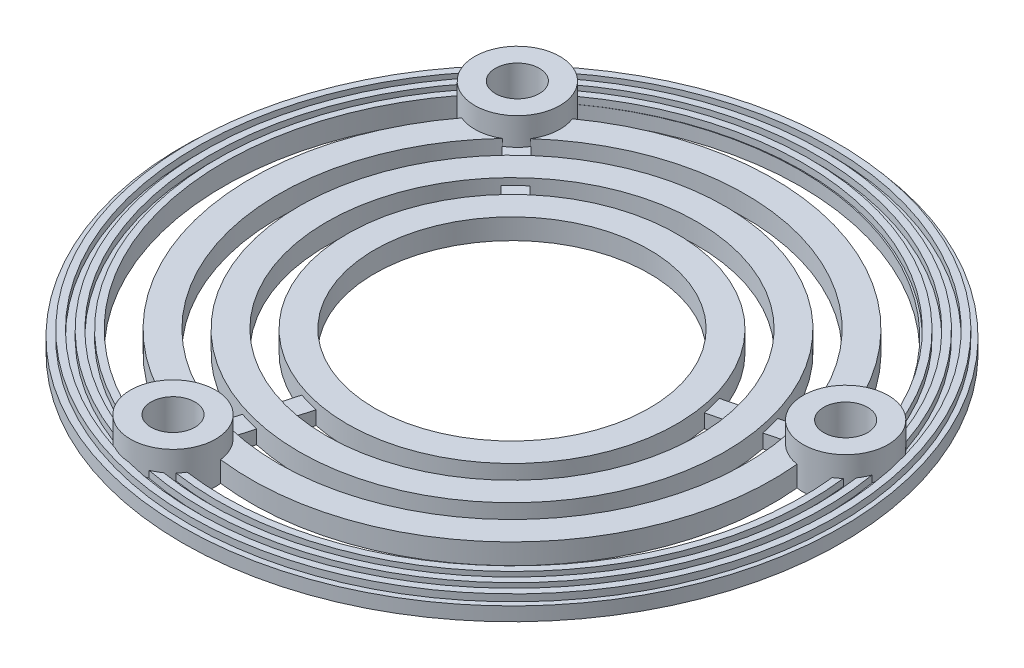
from build123d import *

# Parameters (mm, degrees)
SKETCH1_R             = 24
SKETCH1_R_2           = 21
BOSS_EXTRUDE1_DEPTH   = 1
SKETCH1_R_3           = 12
SKETCH1_R_4           = 10
BOSS_EXTRUDE1_2_DEPTH = 1
SKETCH1_R_5           = 15.5
SKETCH1_R_6           = 13.5
BOSS_EXTRUDE1_3_DEPTH = 1
SKETCH1_R_7           = 19
SKETCH1_R_8           = 17
BOSS_EXTRUDE1_4_DEPTH = 1
BOSS_EXTRUDE2_DEPTH   = 1
CIRPATTERN1_COUNT     = 3
SKETCH5_R             = 23.563954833
SKETCH5_R_2           = 23.063954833
SKETCH5_R_3           = 22.563954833
SKETCH5_R_4           = 22.063954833
SKETCH5_R_5           = 21.563954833
BOSS_EXTRUDE4_DEPTH   = 0.5
SKETCH6_R             = 10
BOSS_EXTRUDE5_DEPTH   = 0.5
BOSS_EXTRUDE3_START   = -1
SKETCH3_R             = 3.1
SKETCH3_R_2           = 1.6
BOSS_EXTRUDE3_DEPTH   = 3
CUT_EXTRUDE1_START    = -5
SKETCH4_R             = 1.6
CUT_EXTRUDE1_DEPTH    = 5
CIRPATTERN2_COUNT     = 3


with BuildPart() as part:
    # Sketch1 → Boss-Extrude1 (new body)
    with BuildSketch(Plane(origin=(0, 0, 0), x_dir=(1, 0, 0), z_dir=(0, 1, 0))):
        with Locations(Location((-0.095100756, -6.830064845, 0), (0, 0, 270))):
            Circle(SKETCH1_R)
        with Locations(Location((-0.095100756, -6.830064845, 0), (0, 0, 270))):
            Circle(SKETCH1_R_2, mode=Mode.SUBTRACT)
    extrude(amount=BOSS_EXTRUDE1_DEPTH)



with BuildPart() as body_2:
    # Sketch1 → Boss-Extrude1 2 (new body)
    with BuildSketch(Plane(origin=(0, 0, 0), x_dir=(1, 0, 0), z_dir=(0, 1, 0))):
        with Locations(Location((-0.095100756, -6.830064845, 0), (0, 0, 270))):
            Circle(SKETCH1_R_3)
        with Locations(Location((-0.095100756, -6.830064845, 0), (0, 0, 270))):
            Circle(SKETCH1_R_4, mode=Mode.SUBTRACT)
    extrude(amount=BOSS_EXTRUDE1_2_DEPTH)


with BuildPart() as body_3:
    # Sketch1 → Boss-Extrude1 3 (new body)
    with BuildSketch(Plane(origin=(0, 0, 0), x_dir=(1, 0, 0), z_dir=(0, 1, 0))):
        with Locations(Location((-0.095100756, -6.830064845, 0), (0, 0, 270))):
            Circle(SKETCH1_R_5)
        with Locations(Location((-0.095100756, -6.830064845, 0), (0, 0, 270))):
            Circle(SKETCH1_R_6, mode=Mode.SUBTRACT)
    extrude(amount=BOSS_EXTRUDE1_3_DEPTH)


with BuildPart() as body_4:
    # Sketch1 → Boss-Extrude1 4 (new body)
    with BuildSketch(Plane(origin=(0, 0, 0), x_dir=(1, 0, 0), z_dir=(0, 1, 0))):
        with Locations(Location((-0.095100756, -6.830064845, 0), (0, 0, 270))):
            Circle(SKETCH1_R_7)
        with Locations(Location((-0.095100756, -6.830064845, 0), (0, 0, 270))):
            Circle(SKETCH1_R_8, mode=Mode.SUBTRACT)
    extrude(amount=BOSS_EXTRUDE1_4_DEPTH)


with BuildPart() as part_1:
    add(part.part)

    add(body_2.part)  # Boss-Extrude2 merges body 2

    add(body_3.part)  # Boss-Extrude2 merges body 3

    add(body_4.part)  # Boss-Extrude2 merges body 4
    # Sketch2 → Boss-Extrude2 (add)
    with BuildSketch(Plane(origin=(0, 1, 0), x_dir=(1, 0, 0), z_dir=(0, 1, 0))):
        Polygon((-7.908749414, 2.277453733), (-16.284527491, 10.887227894), (-17.359697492, 9.841278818), (-8.983919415, 1.231504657), align=None)
    boss_extrude2 = extrude(amount=-BOSS_EXTRUDE2_DEPTH)

    # CirPattern1: Boss-Extrude2 ×3 about axis
    cirpattern1_axis = Axis((-0.095100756, 0, 6.830064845), (0, 1, 0))
    for i in range(1, CIRPATTERN1_COUNT):
        add(boss_extrude2.rotate(cirpattern1_axis, i * 360 / CIRPATTERN1_COUNT))

    # Sketch5 → Boss-Extrude4 (add)
    # profile 1 of 3: a face of its own
    with BuildSketch(Plane(origin=(0, 1, 0), x_dir=(1, 0, 0), z_dir=(0, 1, 0))):
        with Locations(Location((0, -6.830064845, 0), (0, 0, 270))):
            Circle(SKETCH5_R)
        with Locations(Location((0, -6.830064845, 0), (0, 0, 270))):
            Circle(SKETCH5_R_2, mode=Mode.SUBTRACT)
    # profile 2 of 3: a face of its own
    with BuildSketch(Plane(origin=(0, 1, 0), x_dir=(1, 0, 0), z_dir=(0, 1, 0))):
        with Locations(Location((0, -6.830064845, 0), (0, 0, 270))):
            Circle(SKETCH5_R_3)
        with Locations(Location((0, -6.830064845, 0), (0, 0, 270))):
            Circle(SKETCH5_R_4, mode=Mode.SUBTRACT)
    # profile 3 of 3: a face of its own
    with BuildSketch(Plane(origin=(0, 1, 0), x_dir=(1, 0, 0), z_dir=(0, 1, 0))):
        with Locations(Location((0, -6.830064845, 0), (0, 0, 270))):
            Circle(SKETCH5_R_5)
        with BuildLine():
            ThreePointArc((-15.26324398, 7.68625619), (7.816198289, 12.730028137), (21.063954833, -6.830064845))
            ThreePointArc((21.063954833, -6.830064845), (8.507699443, -26.099451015), (-14.191461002, -22.395816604))
            ThreePointArc((-14.191461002, -22.395816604), (-21.081703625, -7.580064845), (-15.266631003, 7.689737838))
            Line((-15.266631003, 7.689737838), (-15.26324398, 7.68625619))
        make_face(mode=Mode.SUBTRACT)
    extrude(amount=BOSS_EXTRUDE4_DEPTH)

    # Sketch6 → Boss-Extrude5 (add)
    # profile 1 of 3: a face of its own
    with BuildSketch(Plane(origin=(0, 1, 0), x_dir=(-1, 0, 0), z_dir=(0, 1, 0))):
        with BuildLine():
            ThreePointArc((13.871048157, -6.255166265), (17.740822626, -0.214684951), (19.095100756, 6.830064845))
            ThreePointArc((19.095100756, 6.830064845), (15.47144418, 17.991071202), (5.982673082, 24.894850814))
            ThreePointArc((5.982673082, 24.894850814), (5.265000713, 25.113175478), (4.539269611, 25.303000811))
            ThreePointArc((4.539269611, 25.303000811), (-13.153587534, 20.44888486), (-18.49324897, 2.896459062))
            ThreePointArc((-18.49324897, 2.896459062), (-18.323487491, 2.165774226), (-18.1250155, 1.44235999))
            ThreePointArc((-18.1250155, 1.44235999), (-5.074799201, -11.453045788), (12.795878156, -7.301115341))
            ThreePointArc((12.795878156, -7.301115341), (13.343789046, -6.788755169), (13.871048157, -6.255166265))
        make_face()
        with BuildLine():
            ThreePointArc((5.437998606, 22.968634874), (13.876052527, 16.784228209), (17.095100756, 6.830064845))
            ThreePointArc((17.095100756, 6.830064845), (15.897984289, 0.56357683), (12.475233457, -4.820356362))
            ThreePointArc((12.475233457, -4.820356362), (11.949190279, -5.355195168), (11.400063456, -5.866305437))
            ThreePointArc((11.400063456, -5.866305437), (-4.530599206, -9.528507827), (-16.184526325, 1.933766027))
            ThreePointArc((-16.184526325, 1.933766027), (-16.384688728, 2.656752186), (-16.552759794, 3.387865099))
            ThreePointArc((-16.552759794, 3.387865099), (-11.758988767, 19.015324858), (3.994595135, 23.37678487))
            ThreePointArc((3.994595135, 23.37678487), (4.720800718, 23.188637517), (5.437998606, 22.968634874))
        make_face(mode=Mode.SUBTRACT)
    # profile 2 of 3: a face of its own
    with BuildSketch(Plane(origin=(0, 1, 0), x_dir=(-1, 0, 0), z_dir=(0, 1, 0))):
        with BuildLine():
            ThreePointArc((11.428166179, -3.744036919), (14.515789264, 1.147306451), (15.595100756, 6.830064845))
            ThreePointArc((15.595100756, 6.830064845), (12.679452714, 15.879047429), (5.029412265, 21.52368829))
            ThreePointArc((5.029412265, 21.52368829), (4.312650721, 21.745234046), (3.586008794, 21.931838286))
            ThreePointArc((3.586008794, 21.931838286), (-10.713039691, 17.940154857), (-15.097106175, 3.75649224))
            ThreePointArc((-15.097106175, 3.75649224), (-14.930589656, 3.024985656), (-14.728872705, 2.302393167))
            ThreePointArc((-14.728872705, 2.302393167), (-4.122449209, -8.085104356), (10.352996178, -4.789985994))
            ThreePointArc((10.352996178, -4.789985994), (10.903241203, -4.280025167), (11.428166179, -3.744036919))
        make_face()
        with BuildLine():
            ThreePointArc((4.48447933, 19.596558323), (11.083881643, 14.67204767), (13.595100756, 6.830064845))
            ThreePointArc((13.595100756, 6.830064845), (12.672738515, 1.925676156), (10.031689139, -2.308546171))
            ThreePointArc((10.031689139, -2.308546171), (9.508642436, -2.846465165), (8.956519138, -3.354495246))
            ThreePointArc((8.956519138, -3.354495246), (-3.578249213, -6.160566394), (-12.787462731, 2.794032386))
            ThreePointArc((-12.787462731, 2.794032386), (-12.991790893, 3.515963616), (-13.155696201, 4.248131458))
            ThreePointArc((-13.155696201, 4.248131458), (-9.318440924, 16.506594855), (3.041075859, 20.00470832))
            ThreePointArc((3.041075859, 20.00470832), (3.768450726, 19.820696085), (4.48447933, 19.596558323))
        make_face(mode=Mode.SUBTRACT)
    # profile 3 of 3: a face of its own
    with BuildSketch(Plane(origin=(0, 1, 0), x_dir=(-1, 0, 0), z_dir=(0, 1, 0))):
        with BuildLine():
            ThreePointArc((8.983919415, -1.231504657), (11.290319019, 2.509522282), (12.095100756, 6.830064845))
            ThreePointArc((12.095100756, 6.830064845), (9.887092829, 13.766698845), (4.075618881, 18.150642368))
            ThreePointArc((4.075618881, 18.150642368), (3.360300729, 18.377292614), (2.63221541, 18.558792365))
            ThreePointArc((2.63221541, 18.558792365), (-8.272491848, 15.431424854), (-11.699066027, 4.6170059))
            ThreePointArc((-11.699066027, 4.6170059), (-11.537691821, 3.884197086), (-11.330832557, 3.162906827))
            ThreePointArc((-11.330832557, 3.162906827), (-3.170099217, -4.717162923), (7.908749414, -2.277453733))
            ThreePointArc((7.908749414, -2.277453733), (8.46269336, -1.771295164), (8.983919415, -1.231504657))
        make_face()
        with Locations(Location((0.095100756, 6.830064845, 0), (0, 0, 90))):
            Circle(SKETCH6_R, mode=Mode.SUBTRACT)
    extrude(amount=BOSS_EXTRUDE5_DEPTH)

    # Sketch3 → Boss-Extrude3 (add)
    with BuildSketch(Plane(origin=(0, 1, 0), x_dir=(1, 0, 0), z_dir=(0, 1, 0)).offset(BOSS_EXTRUDE3_START)):
        with Locations(Location((-14.04108843, 7.50553517, 0), (0, 0, 95.533088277))):
            Circle(SKETCH3_R)
        with Locations(Location((-14.04108843, 7.50553517, 0), (0, 0, 81.209551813))):
            Circle(SKETCH3_R_2, mode=Mode.SUBTRACT)
    boss_extrude3 = extrude(amount=BOSS_EXTRUDE3_DEPTH)

    # Sketch4 → Cut-Extrude1 (cut)
    with BuildSketch(Plane(origin=(0, 3, 0), x_dir=(1, 0, 0), z_dir=(0, 1, 0)).offset(CUT_EXTRUDE1_START)):
        with Locations(Location((-14.04108843, 7.50553517, 0), (0, 0, 270))):
            Circle(SKETCH4_R)
    cut_extrude1 = extrude(amount=CUT_EXTRUDE1_DEPTH, mode=Mode.SUBTRACT)

    # CirPattern2: Boss-Extrude3, Cut-Extrude1 ×3 about axis
    cirpattern2_axis = Axis((-0.095100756, 0, 6.830064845), (0, 1, 0))
    add([boss_extrude3.rotate(cirpattern2_axis, i * 360 / CIRPATTERN2_COUNT) for i in range(1, CIRPATTERN2_COUNT)])
    add([cut_extrude1.rotate(cirpattern2_axis, i * 360 / CIRPATTERN2_COUNT) for i in range(1, CIRPATTERN2_COUNT)], mode=Mode.SUBTRACT)


solid = part_1.part
